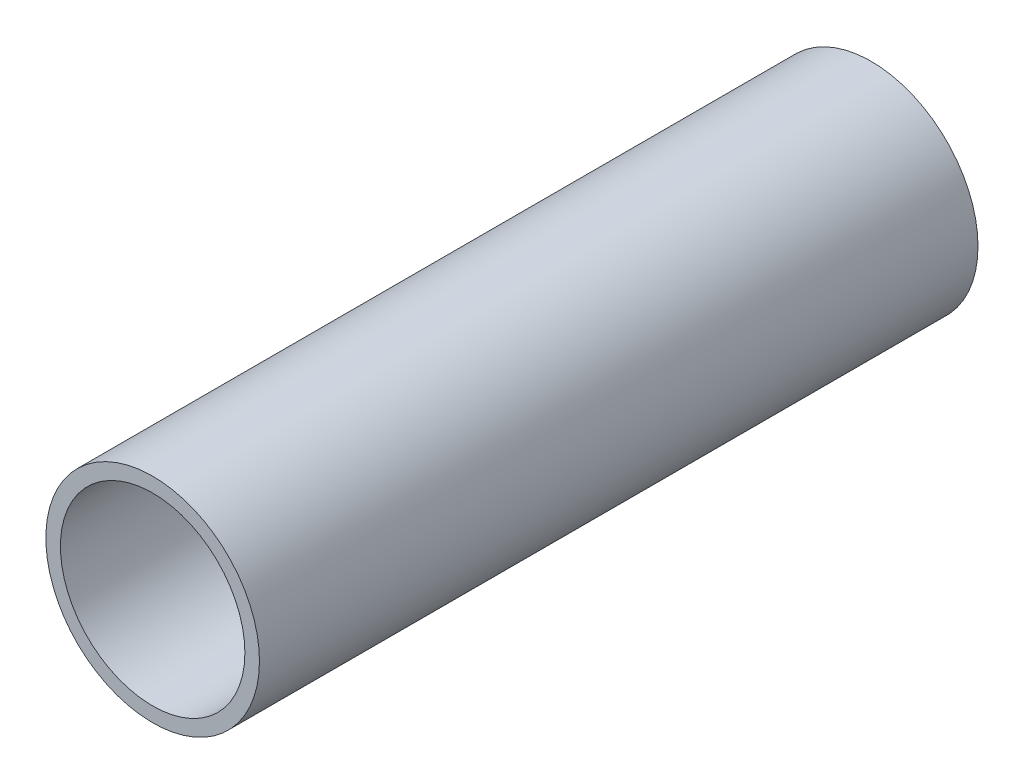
from build123d import *

# Parameters (mm, degrees)
SKETCH1_R           = 5.5
BOSS_EXTRUDE1_DEPTH = 37
SKETCH2_R           = 4.75
CUT_EXTRUDE1_DEPTH  = 37


with BuildPart() as part:
    # Sketch1 → Boss-Extrude1 (new body)
    with BuildSketch(Plane.XY):
        Circle(SKETCH1_R)
    extrude(amount=BOSS_EXTRUDE1_DEPTH)

    # Sketch2 → Cut-Extrude1 (cut)
    with BuildSketch(Plane.XY.offset(37)):
        Circle(SKETCH2_R)
    extrude(amount=-CUT_EXTRUDE1_DEPTH, mode=Mode.SUBTRACT)


solid = part.part
